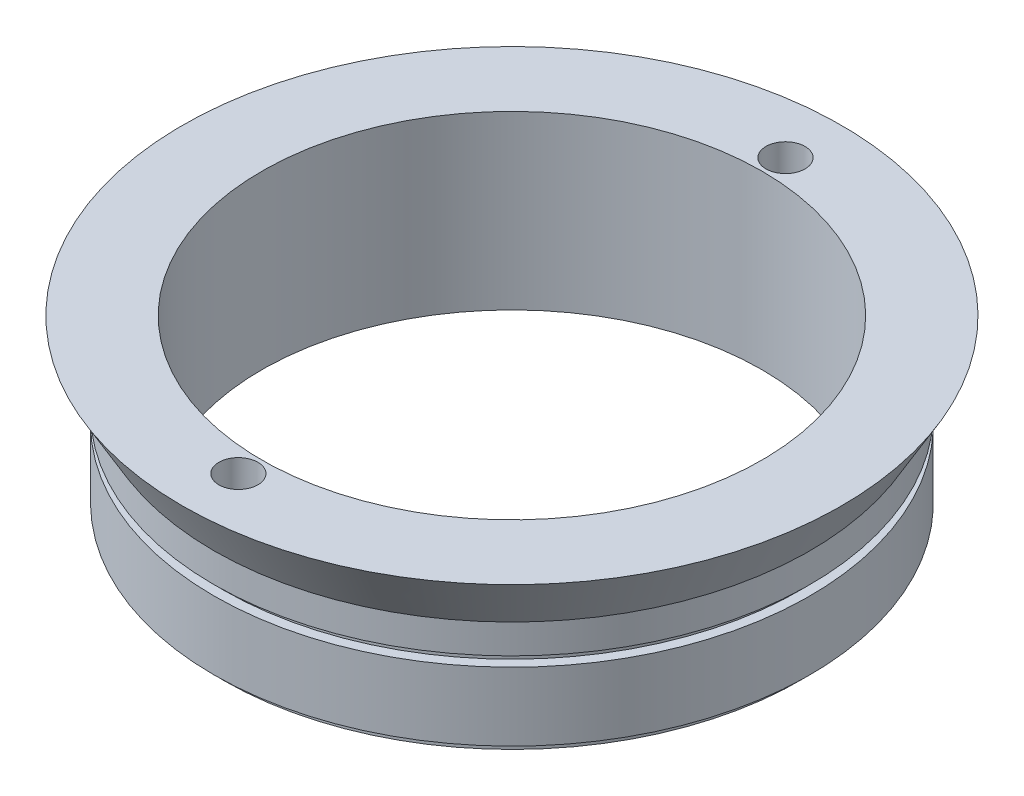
from build123d import *

# Parameters (mm, degrees)
SKETCH3_R                    = 12.8016
CUT_EXTRUDE1_DEPTH           = 26.424458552
SKETCH4_W                    = 0.5
SKETCH4_H                    = 0.5
F_2_0_2_DIAMETER_HOLE1_D     = 2
F_2_0_2_DIAMETER_HOLE1_DEPTH = 3
F_2_0_2_DIAMETER_HOLE1_TIP   = 0.600860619


with BuildPart() as part:
    # Sketch1 → Revolve1 (revolve)
    with BuildSketch(Plane(origin=(0, 0, 0), x_dir=(0, 0, -1), z_dir=(1, 0, 0)), mode=Mode.PRIVATE) as revolve1_sk:
        Polygon((0, 0), (15.25, 0), (15.25, 6), (16.866580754, 8.8), (0, 8.8), align=None)
    revolve(revolve1_sk.sketch.rotate(Axis((0, 8.8, 0), (0, -1, 0)), 180), axis=Axis((0, 8.8, 0), (0, -1, 0)))

    # Sketch3 → Cut-Extrude1 (cut, through all)
    with BuildSketch(Plane.XZ):
        with Locations(Location((0, 0, 0), (0, 0, 270))):
            Circle(SKETCH3_R)
    extrude(amount=-CUT_EXTRUDE1_DEPTH, mode=Mode.SUBTRACT)

    # Sketch4 → Cut-Revolve2 (revolve, cut)
    with BuildSketch(Plane(origin=(0, 0, 0), x_dir=(0, 0, -1), z_dir=(1, 0, 0))):
        with Locations((-15, 4.25)):
            Rectangle(SKETCH4_W, SKETCH4_H)
        with Locations((-15, 0.25)):
            Rectangle(SKETCH4_W, SKETCH4_H)
    revolve(axis=Axis((0, 6, 0), (0, 1, 0)), mode=Mode.SUBTRACT)

    # 2.0 _2_ Diameter Hole1
    with Locations(Plane(origin=(0, 8.8, 0), x_dir=(1, 0, 0), z_dir=(0, 1, 0))):
        with Locations((0, 14), (0, -14)):
            Hole(F_2_0_2_DIAMETER_HOLE1_D / 2, depth=F_2_0_2_DIAMETER_HOLE1_DEPTH)
            with Locations((0, 0, -(F_2_0_2_DIAMETER_HOLE1_DEPTH + F_2_0_2_DIAMETER_HOLE1_TIP / 2))):  # 118° drill point
                Cone(0, F_2_0_2_DIAMETER_HOLE1_D / 2, F_2_0_2_DIAMETER_HOLE1_TIP, mode=Mode.SUBTRACT)


solid = part.part
